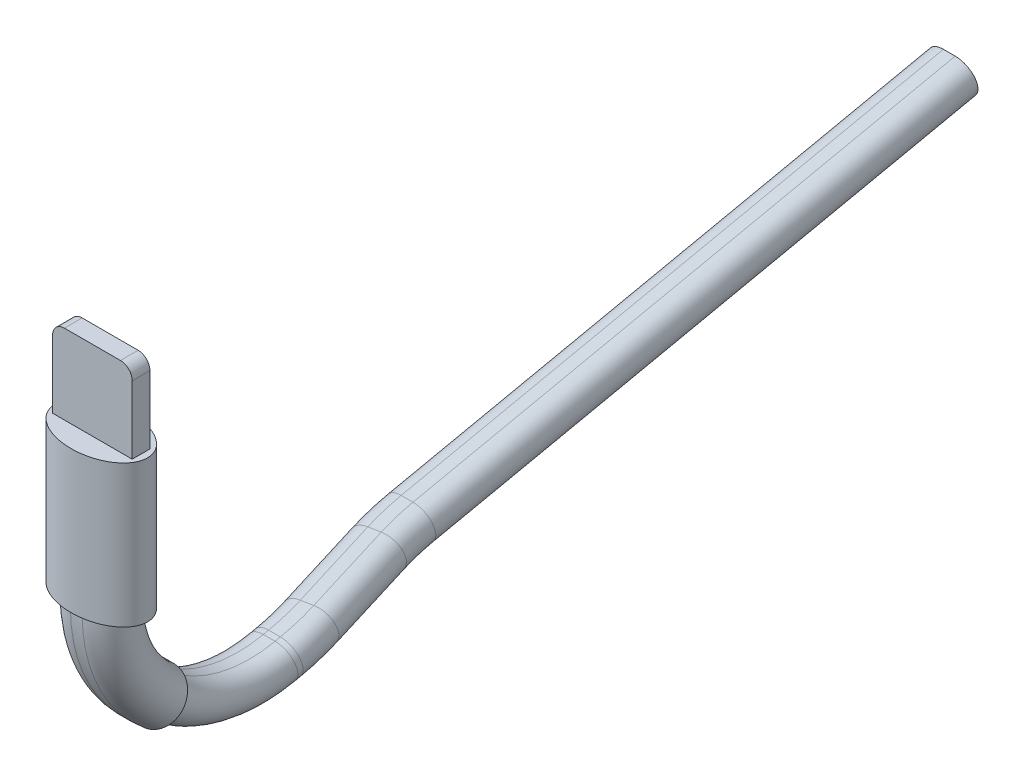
ISO-10303-21;
HEADER;
FILE_DESCRIPTION(('STEP AP214'),'2;1');
FILE_NAME('part.step','',(''),(''),'','','');
FILE_SCHEMA(('AUTOMOTIVE_DESIGN { 1 0 10303 214 1 1 1 1 }'));
ENDSEC;
DATA;
#1=APPLICATION_CONTEXT('core data for automotive mechanical design processes');
#2=APPLICATION_PROTOCOL_DEFINITION('international standard','automotive_design',2000,#1);
#3=PRODUCT_CONTEXT('',#1,'mechanical');
#4=PRODUCT('Part','Part','',(#3));
#5=PRODUCT_RELATED_PRODUCT_CATEGORY('part','',(#4));
#6=PRODUCT_DEFINITION_FORMATION('','',#4);
#7=PRODUCT_DEFINITION_CONTEXT('part definition',#1,'design');
#8=PRODUCT_DEFINITION('design','',#6,#7);
#9=PRODUCT_DEFINITION_SHAPE('','',#8);
#10=(LENGTH_UNIT() NAMED_UNIT(*) SI_UNIT(.MILLI.,.METRE.));
#11=(NAMED_UNIT(*) PLANE_ANGLE_UNIT() SI_UNIT($,.RADIAN.));
#12=(NAMED_UNIT(*) SI_UNIT($,.STERADIAN.) SOLID_ANGLE_UNIT());
#13=UNCERTAINTY_MEASURE_WITH_UNIT(LENGTH_MEASURE(1.E-05),#10,'distance_accuracy_value','');
#14=(GEOMETRIC_REPRESENTATION_CONTEXT(3) GLOBAL_UNCERTAINTY_ASSIGNED_CONTEXT((#13)) GLOBAL_UNIT_ASSIGNED_CONTEXT((#10,
#11,#12)) REPRESENTATION_CONTEXT('',''));
#15=CARTESIAN_POINT('',(0.,0.,0.));
#16=DIRECTION('',(0.,0.,1.));
#17=DIRECTION('',(1.,0.,0.));
#18=AXIS2_PLACEMENT_3D('',#15,#16,#17);
#19=CARTESIAN_POINT('',(0.,12.05,0.));
#20=DIRECTION('',(0.,1.,0.));
#21=DIRECTION('',(0.,0.,1.));
#22=AXIS2_PLACEMENT_3D('',#19,#20,#21);
#23=PLANE('',#22);
#24=CARTESIAN_POINT('',(0.,12.05,0.));
#25=DIRECTION('',(0.,1.,0.));
#26=DIRECTION('',(1.,0.,0.));
#27=AXIS2_PLACEMENT_3D('',#24,#25,#26);
#28=ELLIPSE('',#27,3.925,2.5625);
#29=CARTESIAN_POINT('',(3.925,12.05,0.));
#30=VERTEX_POINT('',#29);
#31=EDGE_CURVE('E409',#30,#30,#28,.T.);
#32=ORIENTED_EDGE('',*,*,#31,.T.);
#33=EDGE_LOOP('',(#32));
#34=FACE_BOUND('',#33,.T.);
#35=DIRECTION('',(-1.,0.,0.));
#36=VECTOR('',#35,1.);
#37=CARTESIAN_POINT('',(-3.375,12.05,-0.75));
#38=LINE('',#37,#36);
#39=CARTESIAN_POINT('',(3.375,12.05,-0.75));
#40=VERTEX_POINT('',#39);
#41=CARTESIAN_POINT('',(-3.375,12.05,-0.75));
#42=VERTEX_POINT('',#41);
#43=EDGE_CURVE('E393',#40,#42,#38,.T.);
#44=ORIENTED_EDGE('',*,*,#43,.F.);
#45=DIRECTION('',(0.,0.,-1.));
#46=VECTOR('',#45,1.);
#47=CARTESIAN_POINT('',(3.375,12.05,-0.75));
#48=LINE('',#47,#46);
#49=CARTESIAN_POINT('',(3.375,12.05,0.75));
#50=VERTEX_POINT('',#49);
#51=EDGE_CURVE('E382',#50,#40,#48,.T.);
#52=ORIENTED_EDGE('',*,*,#51,.F.);
#53=DIRECTION('',(1.,0.,0.));
#54=VECTOR('',#53,1.);
#55=CARTESIAN_POINT('',(-3.375,12.05,0.75));
#56=LINE('',#55,#54);
#57=CARTESIAN_POINT('',(-3.375,12.05,0.75));
#58=VERTEX_POINT('',#57);
#59=EDGE_CURVE('E387',#58,#50,#56,.T.);
#60=ORIENTED_EDGE('',*,*,#59,.F.);
#61=DIRECTION('',(0.,0.,1.));
#62=VECTOR('',#61,1.);
#63=CARTESIAN_POINT('',(-3.375,12.05,-0.75));
#64=LINE('',#63,#62);
#65=EDGE_CURVE('E396',#42,#58,#64,.T.);
#66=ORIENTED_EDGE('',*,*,#65,.F.);
#67=EDGE_LOOP('',(#44,#52,#60,#66));
#68=FACE_BOUND('',#67,.T.);
#69=ADVANCED_FACE('F33',(#34,#68),#23,.T.);
#70=DIRECTION('',(0.,-1.,0.));
#71=VECTOR('',#70,1.);
#72=SURFACE_OF_LINEAR_EXTRUSION('',#28,#71);
#73=ORIENTED_EDGE('',*,*,#31,.F.);
#74=EDGE_LOOP('',(#73));
#75=FACE_BOUND('',#74,.T.);
#76=CARTESIAN_POINT('',(0.,0.,0.));
#77=DIRECTION('',(0.,1.,0.));
#78=DIRECTION('',(1.,0.,0.));
#79=AXIS2_PLACEMENT_3D('',#76,#77,#78);
#80=ELLIPSE('',#79,3.925,2.5625);
#81=CARTESIAN_POINT('',(3.925,0.,0.));
#82=VERTEX_POINT('',#81);
#83=EDGE_CURVE('E408',#82,#82,#80,.T.);
#84=ORIENTED_EDGE('',*,*,#83,.T.);
#85=EDGE_LOOP('',(#84));
#86=FACE_BOUND('',#85,.T.);
#87=ADVANCED_FACE('F416',(#75,#86),#72,.F.);
#88=CARTESIAN_POINT('',(0.,0.,0.));
#89=DIRECTION('',(0.,1.,0.));
#90=DIRECTION('',(0.,0.,1.));
#91=AXIS2_PLACEMENT_3D('',#88,#89,#90);
#92=PLANE('',#91);
#93=CARTESIAN_POINT('',(-0.5,0.,0.));
#94=DIRECTION('',(0.,-1.,0.));
#95=DIRECTION('',(0.,0.,-1.));
#96=AXIS2_PLACEMENT_3D('',#93,#94,#95);
#97=CIRCLE('',#96,2.125);
#98=CARTESIAN_POINT('',(-0.5,0.,2.125));
#99=VERTEX_POINT('',#98);
#100=CARTESIAN_POINT('',(-0.5,0.,-2.125));
#101=VERTEX_POINT('',#100);
#102=EDGE_CURVE('E53',#99,#101,#97,.T.);
#103=ORIENTED_EDGE('',*,*,#102,.F.);
#104=DIRECTION('',(-1.,0.,0.));
#105=VECTOR('',#104,1.);
#106=CARTESIAN_POINT('',(-0.5,0.,2.125));
#107=LINE('',#106,#105);
#108=CARTESIAN_POINT('',(0.5,0.,2.125));
#109=VERTEX_POINT('',#108);
#110=EDGE_CURVE('E327',#109,#99,#107,.T.);
#111=ORIENTED_EDGE('',*,*,#110,.F.);
#112=CARTESIAN_POINT('',(0.5,0.,0.));
#113=DIRECTION('',(0.,-1.,0.));
#114=DIRECTION('',(0.,0.,-1.));
#115=AXIS2_PLACEMENT_3D('',#112,#113,#114);
#116=CIRCLE('',#115,2.125);
#117=CARTESIAN_POINT('',(0.500000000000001,0.,-2.125));
#118=VERTEX_POINT('',#117);
#119=EDGE_CURVE('E324',#118,#109,#116,.T.);
#120=ORIENTED_EDGE('',*,*,#119,.F.);
#121=DIRECTION('',(1.,0.,0.));
#122=VECTOR('',#121,1.);
#123=CARTESIAN_POINT('',(-0.5,0.,-2.125));
#124=LINE('',#123,#122);
#125=EDGE_CURVE('E48',#101,#118,#124,.T.);
#126=ORIENTED_EDGE('',*,*,#125,.F.);
#127=EDGE_LOOP('',(#103,#111,#120,#126));
#128=FACE_BOUND('',#127,.T.);
#129=ORIENTED_EDGE('',*,*,#83,.F.);
#130=EDGE_LOOP('',(#129));
#131=FACE_BOUND('',#130,.T.);
#132=ADVANCED_FACE('F419',(#128,#131),#92,.F.);
#133=CARTESIAN_POINT('',(3.375,18.8,-0.75));
#134=DIRECTION('',(-1.,0.,0.));
#135=DIRECTION('',(0.,0.,1.));
#136=AXIS2_PLACEMENT_3D('',#133,#134,#135);
#137=PLANE('',#136);
#138=DIRECTION('',(0.,-1.,0.));
#139=VECTOR('',#138,1.);
#140=CARTESIAN_POINT('',(3.375,18.8,-0.75));
#141=LINE('',#140,#139);
#142=CARTESIAN_POINT('',(3.375,17.8,-0.75));
#143=VERTEX_POINT('',#142);
#144=EDGE_CURVE('E406',#143,#40,#141,.T.);
#145=ORIENTED_EDGE('',*,*,#144,.F.);
#146=DIRECTION('',(0.,0.,-1.));
#147=VECTOR('',#146,1.);
#148=CARTESIAN_POINT('',(3.375,17.8,0.75));
#149=LINE('',#148,#147);
#150=CARTESIAN_POINT('',(3.375,17.8,0.75));
#151=VERTEX_POINT('',#150);
#152=EDGE_CURVE('E41',#143,#151,#149,.F.);
#153=ORIENTED_EDGE('',*,*,#152,.T.);
#154=DIRECTION('',(0.,-1.,0.));
#155=VECTOR('',#154,1.);
#156=CARTESIAN_POINT('',(3.375,18.8,0.75));
#157=LINE('',#156,#155);
#158=EDGE_CURVE('E390',#151,#50,#157,.T.);
#159=ORIENTED_EDGE('',*,*,#158,.T.);
#160=ORIENTED_EDGE('',*,*,#51,.T.);
#161=EDGE_LOOP('',(#145,#153,#159,#160));
#162=FACE_BOUND('',#161,.T.);
#163=ADVANCED_FACE('F442',(#162),#137,.F.);
#164=CARTESIAN_POINT('',(-3.375,18.8,-0.75));
#165=DIRECTION('',(0.,0.,1.));
#166=DIRECTION('',(1.,0.,0.));
#167=AXIS2_PLACEMENT_3D('',#164,#165,#166);
#168=PLANE('',#167);
#169=DIRECTION('',(0.,-1.,0.));
#170=VECTOR('',#169,1.);
#171=CARTESIAN_POINT('',(-3.375,18.8,-0.75));
#172=LINE('',#171,#170);
#173=CARTESIAN_POINT('',(-3.375,17.8,-0.75));
#174=VERTEX_POINT('',#173);
#175=EDGE_CURVE('E404',#174,#42,#172,.T.);
#176=ORIENTED_EDGE('',*,*,#175,.F.);
#177=CARTESIAN_POINT('',(-2.375,17.8,-0.75));
#178=DIRECTION('',(0.,0.,1.));
#179=DIRECTION('',(1.,0.,0.));
#180=AXIS2_PLACEMENT_3D('',#177,#178,#179);
#181=CIRCLE('',#180,1.);
#182=CARTESIAN_POINT('',(-2.375,18.8,-0.75));
#183=VERTEX_POINT('',#182);
#184=EDGE_CURVE('E858',#174,#183,#181,.F.);
#185=ORIENTED_EDGE('',*,*,#184,.T.);
#186=DIRECTION('',(-1.,0.,0.));
#187=VECTOR('',#186,1.);
#188=CARTESIAN_POINT('',(-3.375,18.8,-0.75));
#189=LINE('',#188,#187);
#190=CARTESIAN_POINT('',(2.375,18.8,-0.75));
#191=VERTEX_POINT('',#190);
#192=EDGE_CURVE('E383',#191,#183,#189,.T.);
#193=ORIENTED_EDGE('',*,*,#192,.F.);
#194=CARTESIAN_POINT('',(2.375,17.8,-0.75));
#195=DIRECTION('',(0.,0.,1.));
#196=DIRECTION('',(1.,0.,0.));
#197=AXIS2_PLACEMENT_3D('',#194,#195,#196);
#198=CIRCLE('',#197,1.);
#199=EDGE_CURVE('E850',#191,#143,#198,.F.);
#200=ORIENTED_EDGE('',*,*,#199,.T.);
#201=ORIENTED_EDGE('',*,*,#144,.T.);
#202=ORIENTED_EDGE('',*,*,#43,.T.);
#203=EDGE_LOOP('',(#176,#185,#193,#200,#201,#202));
#204=FACE_BOUND('',#203,.T.);
#205=ADVANCED_FACE('F445',(#204),#168,.F.);
#206=CARTESIAN_POINT('',(-3.375,18.8,-0.75));
#207=DIRECTION('',(1.,0.,0.));
#208=DIRECTION('',(0.,0.,-1.));
#209=AXIS2_PLACEMENT_3D('',#206,#207,#208);
#210=PLANE('',#209);
#211=DIRECTION('',(0.,-1.,0.));
#212=VECTOR('',#211,1.);
#213=CARTESIAN_POINT('',(-3.375,18.8,0.75));
#214=LINE('',#213,#212);
#215=CARTESIAN_POINT('',(-3.375,17.8,0.75));
#216=VERTEX_POINT('',#215);
#217=EDGE_CURVE('E402',#216,#58,#214,.T.);
#218=ORIENTED_EDGE('',*,*,#217,.F.);
#219=DIRECTION('',(0.,0.,1.));
#220=VECTOR('',#219,1.);
#221=CARTESIAN_POINT('',(-3.375,17.8,-0.75));
#222=LINE('',#221,#220);
#223=EDGE_CURVE('E855',#216,#174,#222,.F.);
#224=ORIENTED_EDGE('',*,*,#223,.T.);
#225=ORIENTED_EDGE('',*,*,#175,.T.);
#226=ORIENTED_EDGE('',*,*,#65,.T.);
#227=EDGE_LOOP('',(#218,#224,#225,#226));
#228=FACE_BOUND('',#227,.T.);
#229=ADVANCED_FACE('F449',(#228),#210,.F.);
#230=CARTESIAN_POINT('',(-3.375,18.8,0.75));
#231=DIRECTION('',(0.,0.,-1.));
#232=DIRECTION('',(-1.,0.,0.));
#233=AXIS2_PLACEMENT_3D('',#230,#231,#232);
#234=PLANE('',#233);
#235=DIRECTION('',(1.,0.,0.));
#236=VECTOR('',#235,1.);
#237=CARTESIAN_POINT('',(-3.375,18.8,0.75));
#238=LINE('',#237,#236);
#239=CARTESIAN_POINT('',(-2.375,18.8,0.75));
#240=VERTEX_POINT('',#239);
#241=CARTESIAN_POINT('',(2.375,18.8,0.75));
#242=VERTEX_POINT('',#241);
#243=EDGE_CURVE('E386',#240,#242,#238,.T.);
#244=ORIENTED_EDGE('',*,*,#243,.F.);
#245=CARTESIAN_POINT('',(-2.375,17.8,0.75));
#246=DIRECTION('',(0.,0.,-1.));
#247=DIRECTION('',(-1.,0.,0.));
#248=AXIS2_PLACEMENT_3D('',#245,#246,#247);
#249=CIRCLE('',#248,1.);
#250=EDGE_CURVE('E838',#240,#216,#249,.F.);
#251=ORIENTED_EDGE('',*,*,#250,.T.);
#252=ORIENTED_EDGE('',*,*,#217,.T.);
#253=ORIENTED_EDGE('',*,*,#59,.T.);
#254=ORIENTED_EDGE('',*,*,#158,.F.);
#255=CARTESIAN_POINT('',(2.375,17.8,0.75));
#256=DIRECTION('',(0.,0.,-1.));
#257=DIRECTION('',(-1.,0.,0.));
#258=AXIS2_PLACEMENT_3D('',#255,#256,#257);
#259=CIRCLE('',#258,1.);
#260=EDGE_CURVE('E842',#151,#242,#259,.F.);
#261=ORIENTED_EDGE('',*,*,#260,.T.);
#262=EDGE_LOOP('',(#244,#251,#252,#253,#254,#261));
#263=FACE_BOUND('',#262,.T.);
#264=ADVANCED_FACE('F432',(#263),#234,.F.);
#265=CARTESIAN_POINT('',(0.,18.8,0.));
#266=DIRECTION('',(0.,1.,0.));
#267=DIRECTION('',(0.,0.,1.));
#268=AXIS2_PLACEMENT_3D('',#265,#266,#267);
#269=PLANE('',#268);
#270=ORIENTED_EDGE('',*,*,#192,.T.);
#271=DIRECTION('',(0.,0.,1.));
#272=VECTOR('',#271,1.);
#273=CARTESIAN_POINT('',(-2.375,18.8,0.75));
#274=LINE('',#273,#272);
#275=EDGE_CURVE('E848',#183,#240,#274,.T.);
#276=ORIENTED_EDGE('',*,*,#275,.T.);
#277=ORIENTED_EDGE('',*,*,#243,.T.);
#278=DIRECTION('',(0.,0.,-1.));
#279=VECTOR('',#278,1.);
#280=CARTESIAN_POINT('',(2.375,18.8,-0.75));
#281=LINE('',#280,#279);
#282=EDGE_CURVE('E413',#242,#191,#281,.T.);
#283=ORIENTED_EDGE('',*,*,#282,.T.);
#284=EDGE_LOOP('',(#270,#276,#277,#283));
#285=FACE_BOUND('',#284,.T.);
#286=ADVANCED_FACE('F424',(#285),#269,.T.);
#287=CARTESIAN_POINT('',(-2.375,17.8,0.));
#288=DIRECTION('',(0.,0.,-1.));
#289=DIRECTION('',(-1.,0.,0.));
#290=AXIS2_PLACEMENT_3D('',#287,#288,#289);
#291=CYLINDRICAL_SURFACE('',#290,1.);
#292=ORIENTED_EDGE('',*,*,#184,.F.);
#293=ORIENTED_EDGE('',*,*,#223,.F.);
#294=ORIENTED_EDGE('',*,*,#250,.F.);
#295=ORIENTED_EDGE('',*,*,#275,.F.);
#296=EDGE_LOOP('',(#292,#293,#294,#295));
#297=FACE_BOUND('',#296,.T.);
#298=ADVANCED_FACE('F422',(#297),#291,.T.);
#299=CARTESIAN_POINT('',(2.375,17.8,0.));
#300=DIRECTION('',(0.,0.,1.));
#301=DIRECTION('',(1.,0.,0.));
#302=AXIS2_PLACEMENT_3D('',#299,#300,#301);
#303=CYLINDRICAL_SURFACE('',#302,1.);
#304=ORIENTED_EDGE('',*,*,#260,.F.);
#305=ORIENTED_EDGE('',*,*,#152,.F.);
#306=ORIENTED_EDGE('',*,*,#199,.F.);
#307=ORIENTED_EDGE('',*,*,#282,.F.);
#308=EDGE_LOOP('',(#304,#305,#306,#307));
#309=FACE_BOUND('',#308,.T.);
#310=ADVANCED_FACE('F35',(#309),#303,.T.);
#311=CARTESIAN_POINT('',(-0.5,0.,-12.0563837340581));
#312=DIRECTION('',(-1.,0.,0.));
#313=DIRECTION('',(0.,0.,1.));
#314=AXIS2_PLACEMENT_3D('',#311,#312,#313);
#315=TOROIDAL_SURFACE('',#314,12.0563837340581,2.125);
#316=CARTESIAN_POINT('',(-0.5,0.,-12.0563837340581));
#317=DIRECTION('',(-1.,0.,0.));
#318=DIRECTION('',(0.,0.,1.));
#319=AXIS2_PLACEMENT_3D('',#316,#317,#318);
#320=CIRCLE('',#319,9.93138373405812);
#321=CARTESIAN_POINT('',(-0.5,-7.59665513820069,-5.65925831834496));
#322=VERTEX_POINT('',#321);
#323=EDGE_CURVE('E350',#322,#101,#320,.T.);
#324=ORIENTED_EDGE('',*,*,#323,.F.);
#325=CARTESIAN_POINT('',(-0.5,-9.22209753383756,-4.2904771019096));
#326=DIRECTION('',(0.,-0.644132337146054,-0.764914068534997));
#327=DIRECTION('',(0.,0.764914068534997,-0.644132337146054));
#328=AXIS2_PLACEMENT_3D('',#325,#326,#327);
#329=CIRCLE('',#328,2.125);
#330=CARTESIAN_POINT('',(-0.5,-10.8475399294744,-2.92169588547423));
#331=VERTEX_POINT('',#330);
#332=EDGE_CURVE('E330',#331,#322,#329,.T.);
#333=ORIENTED_EDGE('',*,*,#332,.F.);
#334=CARTESIAN_POINT('',(-0.5,0.,-12.0563837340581));
#335=DIRECTION('',(-1.,0.,0.));
#336=DIRECTION('',(0.,0.,1.));
#337=AXIS2_PLACEMENT_3D('',#334,#335,#336);
#338=CIRCLE('',#337,14.1813837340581);
#339=EDGE_CURVE('E342',#331,#99,#338,.T.);
#340=ORIENTED_EDGE('',*,*,#339,.T.);
#341=ORIENTED_EDGE('',*,*,#102,.T.);
#342=EDGE_LOOP('',(#324,#333,#340,#341));
#343=FACE_BOUND('',#342,.T.);
#344=ADVANCED_FACE('F430',(#343),#315,.T.);
#345=CARTESIAN_POINT('',(0.,0.,-12.0563837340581));
#346=DIRECTION('',(-1.,0.,0.));
#347=DIRECTION('',(0.,0.,1.));
#348=AXIS2_PLACEMENT_3D('',#345,#346,#347);
#349=CYLINDRICAL_SURFACE('',#348,9.93138373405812);
#350=CARTESIAN_POINT('',(0.500000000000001,0.,-12.0563837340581));
#351=DIRECTION('',(-1.,0.,0.));
#352=DIRECTION('',(0.,0.,1.));
#353=AXIS2_PLACEMENT_3D('',#350,#351,#352);
#354=CIRCLE('',#353,9.93138373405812);
#355=CARTESIAN_POINT('',(0.500000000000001,-7.59665513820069,-5.65925831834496));
#356=VERTEX_POINT('',#355);
#357=EDGE_CURVE('E347',#356,#118,#354,.T.);
#358=ORIENTED_EDGE('',*,*,#357,.F.);
#359=DIRECTION('',(1.,0.,0.));
#360=VECTOR('',#359,1.);
#361=CARTESIAN_POINT('',(-0.5,-7.59665513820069,-5.65925831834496));
#362=LINE('',#361,#360);
#363=EDGE_CURVE('E333',#322,#356,#362,.T.);
#364=ORIENTED_EDGE('',*,*,#363,.F.);
#365=ORIENTED_EDGE('',*,*,#323,.T.);
#366=ORIENTED_EDGE('',*,*,#125,.T.);
#367=EDGE_LOOP('',(#358,#364,#365,#366));
#368=FACE_BOUND('',#367,.T.);
#369=ADVANCED_FACE('F475',(#368),#349,.F.);
#370=CARTESIAN_POINT('',(0.5,0.,-12.0563837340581));
#371=DIRECTION('',(-1.,0.,0.));
#372=DIRECTION('',(0.,0.,1.));
#373=AXIS2_PLACEMENT_3D('',#370,#371,#372);
#374=TOROIDAL_SURFACE('',#373,12.0563837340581,2.125);
#375=CARTESIAN_POINT('',(0.499999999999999,0.,-12.0563837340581));
#376=DIRECTION('',(-1.,0.,0.));
#377=DIRECTION('',(0.,0.,1.));
#378=AXIS2_PLACEMENT_3D('',#375,#376,#377);
#379=CIRCLE('',#378,14.1813837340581);
#380=CARTESIAN_POINT('',(0.499999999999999,-10.8475399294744,-2.92169588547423));
#381=VERTEX_POINT('',#380);
#382=EDGE_CURVE('E344',#381,#109,#379,.T.);
#383=ORIENTED_EDGE('',*,*,#382,.F.);
#384=CARTESIAN_POINT('',(0.5,-9.22209753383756,-4.2904771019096));
#385=DIRECTION('',(0.,-0.644132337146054,-0.764914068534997));
#386=DIRECTION('',(0.,0.764914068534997,-0.644132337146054));
#387=AXIS2_PLACEMENT_3D('',#384,#385,#386);
#388=CIRCLE('',#387,2.125);
#389=EDGE_CURVE('E336',#356,#381,#388,.T.);
#390=ORIENTED_EDGE('',*,*,#389,.F.);
#391=ORIENTED_EDGE('',*,*,#357,.T.);
#392=ORIENTED_EDGE('',*,*,#119,.T.);
#393=EDGE_LOOP('',(#383,#390,#391,#392));
#394=FACE_BOUND('',#393,.T.);
#395=ADVANCED_FACE('F478',(#394),#374,.T.);
#396=CARTESIAN_POINT('',(0.,0.,-12.0563837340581));
#397=DIRECTION('',(-1.,0.,0.));
#398=DIRECTION('',(0.,0.,1.));
#399=AXIS2_PLACEMENT_3D('',#396,#397,#398);
#400=CYLINDRICAL_SURFACE('',#399,14.1813837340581);
#401=DIRECTION('',(-1.,0.,0.));
#402=VECTOR('',#401,1.);
#403=CARTESIAN_POINT('',(-0.5,-10.8475399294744,-2.92169588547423));
#404=LINE('',#403,#402);
#405=EDGE_CURVE('E339',#381,#331,#404,.T.);
#406=ORIENTED_EDGE('',*,*,#405,.F.);
#407=ORIENTED_EDGE('',*,*,#382,.T.);
#408=ORIENTED_EDGE('',*,*,#110,.T.);
#409=ORIENTED_EDGE('',*,*,#339,.F.);
#410=EDGE_LOOP('',(#406,#407,#408,#409));
#411=FACE_BOUND('',#410,.T.);
#412=ADVANCED_FACE('F482',(#411),#400,.T.);
#413=CARTESIAN_POINT('',(-0.5,-9.22209753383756,-4.2904771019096));
#414=DIRECTION('',(0.,-0.644132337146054,-0.764914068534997));
#415=DIRECTION('',(0.,0.764914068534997,-0.644132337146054));
#416=AXIS2_PLACEMENT_3D('',#413,#414,#415);
#417=PLANE('',#416);
#418=DIRECTION('',(-1.,0.,0.));
#419=VECTOR('',#418,1.);
#420=CARTESIAN_POINT('',(0.,-8.01735787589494,-5.30498553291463));
#421=LINE('',#420,#419);
#422=CARTESIAN_POINT('',(0.499999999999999,-8.01735787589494,-5.30498553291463));
#423=VERTEX_POINT('',#422);
#424=CARTESIAN_POINT('',(-0.5,-8.01735787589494,-5.30498553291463));
#425=VERTEX_POINT('',#424);
#426=EDGE_CURVE('E11',#423,#425,#421,.T.);
#427=ORIENTED_EDGE('',*,*,#426,.T.);
#428=CARTESIAN_POINT('',(-0.5,-9.22209753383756,-4.2904771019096));
#429=DIRECTION('',(0.,-0.644132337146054,-0.764914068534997));
#430=DIRECTION('',(0.,0.764914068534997,-0.644132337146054));
#431=AXIS2_PLACEMENT_3D('',#428,#429,#430);
#432=CIRCLE('',#431,1.575);
#433=CARTESIAN_POINT('',(-0.5,-10.4268371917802,-3.27596867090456));
#434=VERTEX_POINT('',#433);
#435=EDGE_CURVE('E358',#425,#434,#432,.F.);
#436=ORIENTED_EDGE('',*,*,#435,.T.);
#437=DIRECTION('',(-1.,0.,0.));
#438=VECTOR('',#437,1.);
#439=CARTESIAN_POINT('',(0.,-10.4268371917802,-3.27596867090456));
#440=LINE('',#439,#438);
#441=CARTESIAN_POINT('',(0.500000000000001,-10.4268371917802,-3.27596867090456));
#442=VERTEX_POINT('',#441);
#443=EDGE_CURVE('E355',#434,#442,#440,.F.);
#444=ORIENTED_EDGE('',*,*,#443,.T.);
#445=CARTESIAN_POINT('',(0.5,-9.22209753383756,-4.2904771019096));
#446=DIRECTION('',(0.,-0.644132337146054,-0.764914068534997));
#447=DIRECTION('',(0.,0.764914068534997,-0.644132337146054));
#448=AXIS2_PLACEMENT_3D('',#445,#446,#447);
#449=CIRCLE('',#448,1.575);
#450=EDGE_CURVE('E352',#442,#423,#449,.F.);
#451=ORIENTED_EDGE('',*,*,#450,.T.);
#452=EDGE_LOOP('',(#427,#436,#444,#451));
#453=FACE_BOUND('',#452,.T.);
#454=ORIENTED_EDGE('',*,*,#332,.T.);
#455=ORIENTED_EDGE('',*,*,#363,.T.);
#456=ORIENTED_EDGE('',*,*,#389,.T.);
#457=ORIENTED_EDGE('',*,*,#405,.T.);
#458=EDGE_LOOP('',(#454,#455,#456,#457));
#459=FACE_BOUND('',#458,.T.);
#460=ADVANCED_FACE('F469',(#453,#459),#417,.T.);
#461=CARTESIAN_POINT('',(0.,0.,-12.0563837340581));
#462=DIRECTION('',(-1.,0.,0.));
#463=DIRECTION('',(0.,0.,1.));
#464=AXIS2_PLACEMENT_3D('',#461,#462,#463);
#465=CYLINDRICAL_SURFACE('',#464,10.4813837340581);
#466=ORIENTED_EDGE('',*,*,#426,.F.);
#467=CARTESIAN_POINT('',(0.499999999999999,0.,-12.0563837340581));
#468=DIRECTION('',(-1.,0.,0.));
#469=DIRECTION('',(0.,0.,1.));
#470=AXIS2_PLACEMENT_3D('',#467,#468,#469);
#471=CIRCLE('',#470,10.4813837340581);
#472=CARTESIAN_POINT('',(0.5,-10.2523403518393,-14.235585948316));
#473=VERTEX_POINT('',#472);
#474=EDGE_CURVE('E373',#473,#423,#471,.T.);
#475=ORIENTED_EDGE('',*,*,#474,.F.);
#476=DIRECTION('',(-1.,0.,0.));
#477=VECTOR('',#476,1.);
#478=CARTESIAN_POINT('',(-0.5,-10.2523403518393,-14.2355859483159));
#479=LINE('',#478,#477);
#480=CARTESIAN_POINT('',(-0.5,-10.2523403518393,-14.235585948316));
#481=VERTEX_POINT('',#480);
#482=EDGE_CURVE('E368',#473,#481,#479,.T.);
#483=ORIENTED_EDGE('',*,*,#482,.T.);
#484=CARTESIAN_POINT('',(-0.5,0.,-12.0563837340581));
#485=DIRECTION('',(-1.,0.,0.));
#486=DIRECTION('',(0.,0.,1.));
#487=AXIS2_PLACEMENT_3D('',#484,#485,#486);
#488=CIRCLE('',#487,10.4813837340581);
#489=EDGE_CURVE('E371',#481,#425,#488,.T.);
#490=ORIENTED_EDGE('',*,*,#489,.T.);
#491=EDGE_LOOP('',(#466,#475,#483,#490));
#492=FACE_BOUND('',#491,.T.);
#493=ADVANCED_FACE('F465',(#492),#465,.F.);
#494=CARTESIAN_POINT('',(0.5,0.,-12.0563837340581));
#495=DIRECTION('',(-1.,0.,0.));
#496=DIRECTION('',(0.,0.,1.));
#497=AXIS2_PLACEMENT_3D('',#494,#495,#496);
#498=TOROIDAL_SURFACE('',#497,12.0563837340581,1.575);
#499=ORIENTED_EDGE('',*,*,#450,.F.);
#500=CARTESIAN_POINT('',(0.500000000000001,0.,-12.0563837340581));
#501=DIRECTION('',(-1.,0.,0.));
#502=DIRECTION('',(0.,0.,1.));
#503=AXIS2_PLACEMENT_3D('',#500,#501,#502);
#504=CIRCLE('',#503,13.6313837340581);
#505=CARTESIAN_POINT('',(0.500000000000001,-13.3335052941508,-14.8905077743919));
#506=VERTEX_POINT('',#505);
#507=EDGE_CURVE('E376',#506,#442,#504,.T.);
#508=ORIENTED_EDGE('',*,*,#507,.F.);
#509=CARTESIAN_POINT('',(0.5,-11.792922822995,-14.5630468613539));
#510=DIRECTION('',(0.,-0.207911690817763,0.978147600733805));
#511=DIRECTION('',(0.,-0.978147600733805,-0.207911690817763));
#512=AXIS2_PLACEMENT_3D('',#509,#510,#511);
#513=CIRCLE('',#512,1.575);
#514=EDGE_CURVE('E365',#506,#473,#513,.T.);
#515=ORIENTED_EDGE('',*,*,#514,.T.);
#516=ORIENTED_EDGE('',*,*,#474,.T.);
#517=EDGE_LOOP('',(#499,#508,#515,#516));
#518=FACE_BOUND('',#517,.T.);
#519=ADVANCED_FACE('F461',(#518),#498,.T.);
#520=CARTESIAN_POINT('',(0.,0.,-12.0563837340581));
#521=DIRECTION('',(-1.,0.,0.));
#522=DIRECTION('',(0.,0.,1.));
#523=AXIS2_PLACEMENT_3D('',#520,#521,#522);
#524=CYLINDRICAL_SURFACE('',#523,13.6313837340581);
#525=ORIENTED_EDGE('',*,*,#443,.F.);
#526=CARTESIAN_POINT('',(-0.5,0.,-12.0563837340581));
#527=DIRECTION('',(-1.,0.,0.));
#528=DIRECTION('',(0.,0.,1.));
#529=AXIS2_PLACEMENT_3D('',#526,#527,#528);
#530=CIRCLE('',#529,13.6313837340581);
#531=CARTESIAN_POINT('',(-0.5,-13.3335052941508,-14.8905077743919));
#532=VERTEX_POINT('',#531);
#533=EDGE_CURVE('E379',#532,#434,#530,.T.);
#534=ORIENTED_EDGE('',*,*,#533,.F.);
#535=DIRECTION('',(1.,0.,0.));
#536=VECTOR('',#535,1.);
#537=CARTESIAN_POINT('',(-0.5,-13.3335052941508,-14.8905077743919));
#538=LINE('',#537,#536);
#539=EDGE_CURVE('E362',#532,#506,#538,.T.);
#540=ORIENTED_EDGE('',*,*,#539,.T.);
#541=ORIENTED_EDGE('',*,*,#507,.T.);
#542=EDGE_LOOP('',(#525,#534,#540,#541));
#543=FACE_BOUND('',#542,.T.);
#544=ADVANCED_FACE('F457',(#543),#524,.T.);
#545=CARTESIAN_POINT('',(-0.5,0.,-12.0563837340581));
#546=DIRECTION('',(-1.,0.,0.));
#547=DIRECTION('',(0.,0.,1.));
#548=AXIS2_PLACEMENT_3D('',#545,#546,#547);
#549=TOROIDAL_SURFACE('',#548,12.0563837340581,1.575);
#550=ORIENTED_EDGE('',*,*,#435,.F.);
#551=ORIENTED_EDGE('',*,*,#489,.F.);
#552=CARTESIAN_POINT('',(-0.5,-11.792922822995,-14.5630468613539));
#553=DIRECTION('',(0.,-0.207911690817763,0.978147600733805));
#554=DIRECTION('',(0.,-0.978147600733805,-0.207911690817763));
#555=AXIS2_PLACEMENT_3D('',#552,#553,#554);
#556=CIRCLE('',#555,1.575);
#557=EDGE_CURVE('E229',#481,#532,#556,.T.);
#558=ORIENTED_EDGE('',*,*,#557,.T.);
#559=ORIENTED_EDGE('',*,*,#533,.T.);
#560=EDGE_LOOP('',(#550,#551,#558,#559));
#561=FACE_BOUND('',#560,.T.);
#562=ADVANCED_FACE('F460',(#561),#549,.T.);
#563=CARTESIAN_POINT('',(-2.05000000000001,-7.43704962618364,-27.4804874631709));
#564=DIRECTION('',(0.,0.978147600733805,0.20791169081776));
#565=DIRECTION('',(0.,-0.20791169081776,0.978147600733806));
#566=AXIS2_PLACEMENT_3D('',#563,#564,#565);
#567=PLANE('',#566);
#568=DIRECTION('',(1.,0.,0.));
#569=VECTOR('',#568,1.);
#570=CARTESIAN_POINT('',(-2.05000000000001,-7.43704962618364,-27.4804874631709));
#571=LINE('',#570,#569);
#572=CARTESIAN_POINT('',(-2.05000000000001,-7.43704962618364,-27.4804874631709));
#573=VERTEX_POINT('',#572);
#574=CARTESIAN_POINT('',(-1.05000000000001,-7.43704962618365,-27.4804874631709));
#575=VERTEX_POINT('',#574);
#576=EDGE_CURVE('E283',#573,#575,#571,.T.);
#577=ORIENTED_EDGE('',*,*,#576,.T.);
#578=DIRECTION('',(0.,0.20791169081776,-0.978147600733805));
#579=VECTOR('',#578,1.);
#580=CARTESIAN_POINT('',(-1.05000000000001,-7.43704962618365,-27.4804874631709));
#581=LINE('',#580,#579);
#582=CARTESIAN_POINT('',(-1.05,2.33548156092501,-73.4566319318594));
#583=VERTEX_POINT('',#582);
#584=EDGE_CURVE('E316',#575,#583,#581,.T.);
#585=ORIENTED_EDGE('',*,*,#584,.T.);
#586=DIRECTION('',(1.,0.,0.));
#587=VECTOR('',#586,1.);
#588=CARTESIAN_POINT('',(-2.05,2.33548156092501,-73.4566319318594));
#589=LINE('',#588,#587);
#590=CARTESIAN_POINT('',(-2.05,2.33548156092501,-73.4566319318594));
#591=VERTEX_POINT('',#590);
#592=EDGE_CURVE('E307',#591,#583,#589,.T.);
#593=ORIENTED_EDGE('',*,*,#592,.F.);
#594=DIRECTION('',(0.,0.20791169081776,-0.978147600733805));
#595=VECTOR('',#594,1.);
#596=CARTESIAN_POINT('',(-2.05000000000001,-7.43704962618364,-27.4804874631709));
#597=LINE('',#596,#595);
#598=EDGE_CURVE('E319',#573,#591,#597,.T.);
#599=ORIENTED_EDGE('',*,*,#598,.F.);
#600=EDGE_LOOP('',(#577,#585,#593,#599));
#601=FACE_BOUND('',#600,.T.);
#602=ADVANCED_FACE('F473',(#601),#567,.T.);
#603=CARTESIAN_POINT('',(-1.05,-8.97763209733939,-27.8079483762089));
#604=DIRECTION('',(0.,0.20791169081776,-0.978147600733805));
#605=DIRECTION('',(0.,0.978147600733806,0.20791169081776));
#606=AXIS2_PLACEMENT_3D('',#603,#604,#605);
#607=CYLINDRICAL_SURFACE('',#606,1.575);
#608=CARTESIAN_POINT('',(-1.05,-8.97763209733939,-27.8079483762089));
#609=DIRECTION('',(0.,0.207911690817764,-0.978147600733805));
#610=DIRECTION('',(0.,0.978147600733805,0.207911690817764));
#611=AXIS2_PLACEMENT_3D('',#608,#609,#610);
#612=CIRCLE('',#611,1.575);
#613=CARTESIAN_POINT('',(-1.05,-10.5182145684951,-28.1354092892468));
#614=VERTEX_POINT('',#613);
#615=EDGE_CURVE('E280',#575,#614,#612,.T.);
#616=ORIENTED_EDGE('',*,*,#615,.T.);
#617=DIRECTION('',(0.,0.20791169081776,-0.978147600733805));
#618=VECTOR('',#617,1.);
#619=CARTESIAN_POINT('',(-1.05,-10.5182145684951,-28.1354092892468));
#620=LINE('',#619,#618);
#621=CARTESIAN_POINT('',(-1.05,-0.74568338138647,-74.1115537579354));
#622=VERTEX_POINT('',#621);
#623=EDGE_CURVE('E313',#614,#622,#620,.T.);
#624=ORIENTED_EDGE('',*,*,#623,.T.);
#625=CARTESIAN_POINT('',(-1.05,0.794899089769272,-73.7840928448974));
#626=DIRECTION('',(0.,0.207911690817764,-0.978147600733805));
#627=DIRECTION('',(0.,0.978147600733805,0.207911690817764));
#628=AXIS2_PLACEMENT_3D('',#625,#626,#627);
#629=CIRCLE('',#628,1.575);
#630=EDGE_CURVE('E304',#583,#622,#629,.T.);
#631=ORIENTED_EDGE('',*,*,#630,.F.);
#632=ORIENTED_EDGE('',*,*,#584,.F.);
#633=EDGE_LOOP('',(#616,#624,#631,#632));
#634=FACE_BOUND('',#633,.T.);
#635=ADVANCED_FACE('F495',(#634),#607,.T.);
#636=CARTESIAN_POINT('',(-1.05,-10.5182145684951,-28.1354092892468));
#637=DIRECTION('',(0.,-0.978147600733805,-0.20791169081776));
#638=DIRECTION('',(0.,0.20791169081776,-0.978147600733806));
#639=AXIS2_PLACEMENT_3D('',#636,#637,#638);
#640=PLANE('',#639);
#641=DIRECTION('',(-1.,0.,0.));
#642=VECTOR('',#641,1.);
#643=CARTESIAN_POINT('',(-1.05,-10.5182145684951,-28.1354092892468));
#644=LINE('',#643,#642);
#645=CARTESIAN_POINT('',(-2.05,-10.5182145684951,-28.1354092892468));
#646=VERTEX_POINT('',#645);
#647=EDGE_CURVE('E277',#614,#646,#644,.T.);
#648=ORIENTED_EDGE('',*,*,#647,.T.);
#649=DIRECTION('',(0.,0.20791169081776,-0.978147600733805));
#650=VECTOR('',#649,1.);
#651=CARTESIAN_POINT('',(-2.05,-10.5182145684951,-28.1354092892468));
#652=LINE('',#651,#650);
#653=CARTESIAN_POINT('',(-2.05,-0.745683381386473,-74.1115537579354));
#654=VERTEX_POINT('',#653);
#655=EDGE_CURVE('E310',#646,#654,#652,.T.);
#656=ORIENTED_EDGE('',*,*,#655,.T.);
#657=DIRECTION('',(-1.,0.,0.));
#658=VECTOR('',#657,1.);
#659=CARTESIAN_POINT('',(-1.05,-0.74568338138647,-74.1115537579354));
#660=LINE('',#659,#658);
#661=EDGE_CURVE('E301',#622,#654,#660,.T.);
#662=ORIENTED_EDGE('',*,*,#661,.F.);
#663=ORIENTED_EDGE('',*,*,#623,.F.);
#664=EDGE_LOOP('',(#648,#656,#662,#663));
#665=FACE_BOUND('',#664,.T.);
#666=ADVANCED_FACE('F499',(#665),#640,.T.);
#667=CARTESIAN_POINT('',(-2.05000000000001,-8.97763209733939,-27.8079483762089));
#668=DIRECTION('',(0.,0.20791169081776,-0.978147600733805));
#669=DIRECTION('',(0.,0.978147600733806,0.20791169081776));
#670=AXIS2_PLACEMENT_3D('',#667,#668,#669);
#671=CYLINDRICAL_SURFACE('',#670,1.575);
#672=CARTESIAN_POINT('',(-2.05000000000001,-8.97763209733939,-27.8079483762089));
#673=DIRECTION('',(0.,0.207911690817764,-0.978147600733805));
#674=DIRECTION('',(0.,0.978147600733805,0.207911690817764));
#675=AXIS2_PLACEMENT_3D('',#672,#673,#674);
#676=CIRCLE('',#675,1.575);
#677=EDGE_CURVE('E274',#646,#573,#676,.T.);
#678=ORIENTED_EDGE('',*,*,#677,.T.);
#679=ORIENTED_EDGE('',*,*,#598,.T.);
#680=CARTESIAN_POINT('',(-2.05,0.794899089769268,-73.7840928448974));
#681=DIRECTION('',(0.,0.207911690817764,-0.978147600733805));
#682=DIRECTION('',(0.,0.978147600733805,0.207911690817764));
#683=AXIS2_PLACEMENT_3D('',#680,#681,#682);
#684=CIRCLE('',#683,1.575);
#685=EDGE_CURVE('E298',#654,#591,#684,.T.);
#686=ORIENTED_EDGE('',*,*,#685,.F.);
#687=ORIENTED_EDGE('',*,*,#655,.F.);
#688=EDGE_LOOP('',(#678,#679,#686,#687));
#689=FACE_BOUND('',#688,.T.);
#690=ADVANCED_FACE('F503',(#689),#671,.T.);
#691=CARTESIAN_POINT('',(-1.80809397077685,-8.08989328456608,-24.4090995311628));
#692=DIRECTION('',(0.,0.978147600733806,0.20791169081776));
#693=DIRECTION('',(0.,-0.20791169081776,0.978147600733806));
#694=AXIS2_PLACEMENT_3D('',#691,#692,#693);
#695=PLANE('',#694);
#696=DIRECTION('',(0.988199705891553,0.0318460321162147,-0.14982380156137));
#697=VECTOR('',#696,1.);
#698=CARTESIAN_POINT('',(-1.80809397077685,-8.08989328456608,-24.4090995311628));
#699=LINE('',#698,#697);
#700=CARTESIAN_POINT('',(-1.80809397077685,-8.08989328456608,-24.4090995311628));
#701=VERTEX_POINT('',#700);
#702=CARTESIAN_POINT('',(-0.819894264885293,-8.05804725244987,-24.5589233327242));
#703=VERTEX_POINT('',#702);
#704=EDGE_CURVE('E259',#701,#703,#699,.T.);
#705=ORIENTED_EDGE('',*,*,#704,.T.);
#706=CARTESIAN_POINT('',(18.45,-7.43704962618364,-27.4804874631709));
#707=DIRECTION('',(0.,-0.978147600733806,-0.20791169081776));
#708=DIRECTION('',(0.,0.20791169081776,-0.978147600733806));
#709=AXIS2_PLACEMENT_3D('',#706,#707,#708);
#710=CIRCLE('',#709,19.5);
#711=EDGE_CURVE('E292',#703,#575,#710,.T.);
#712=ORIENTED_EDGE('',*,*,#711,.T.);
#713=ORIENTED_EDGE('',*,*,#576,.F.);
#714=CARTESIAN_POINT('',(18.45,-7.43704962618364,-27.4804874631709));
#715=DIRECTION('',(0.,-0.978147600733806,-0.20791169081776));
#716=DIRECTION('',(0.,0.20791169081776,-0.978147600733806));
#717=AXIS2_PLACEMENT_3D('',#714,#715,#716);
#718=CIRCLE('',#717,20.5);
#719=EDGE_CURVE('E295',#701,#573,#718,.T.);
#720=ORIENTED_EDGE('',*,*,#719,.F.);
#721=EDGE_LOOP('',(#705,#712,#713,#720));
#722=FACE_BOUND('',#721,.T.);
#723=ADVANCED_FACE('F507',(#722),#695,.T.);
#724=CARTESIAN_POINT('',(18.45,-8.97763209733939,-27.8079483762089));
#725=DIRECTION('',(0.,-0.978147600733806,-0.20791169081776));
#726=DIRECTION('',(0.,0.20791169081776,-0.978147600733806));
#727=AXIS2_PLACEMENT_3D('',#724,#725,#726);
#728=TOROIDAL_SURFACE('',#727,19.5,1.575);
#729=CARTESIAN_POINT('',(-0.819894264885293,-9.59862972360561,-24.8863842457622));
#730=DIRECTION('',(-0.153170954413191,0.20545827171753,-0.966605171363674));
#731=DIRECTION('',(0.,0.978147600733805,0.207911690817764));
#732=AXIS2_PLACEMENT_3D('',#729,#730,#731);
#733=CIRCLE('',#732,1.575);
#734=CARTESIAN_POINT('',(-0.819894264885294,-11.1392121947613,-25.2138451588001));
#735=VERTEX_POINT('',#734);
#736=EDGE_CURVE('E256',#703,#735,#733,.T.);
#737=ORIENTED_EDGE('',*,*,#736,.T.);
#738=CARTESIAN_POINT('',(18.45,-10.5182145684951,-28.1354092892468));
#739=DIRECTION('',(0.,-0.978147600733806,-0.20791169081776));
#740=DIRECTION('',(0.,0.20791169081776,-0.978147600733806));
#741=AXIS2_PLACEMENT_3D('',#738,#739,#740);
#742=CIRCLE('',#741,19.5);
#743=EDGE_CURVE('E289',#735,#614,#742,.T.);
#744=ORIENTED_EDGE('',*,*,#743,.T.);
#745=ORIENTED_EDGE('',*,*,#615,.F.);
#746=ORIENTED_EDGE('',*,*,#711,.F.);
#747=EDGE_LOOP('',(#737,#744,#745,#746));
#748=FACE_BOUND('',#747,.T.);
#749=ADVANCED_FACE('F511',(#748),#728,.T.);
#750=CARTESIAN_POINT('',(-0.819894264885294,-11.1392121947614,-25.2138451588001));
#751=DIRECTION('',(0.,-0.978147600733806,-0.20791169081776));
#752=DIRECTION('',(0.,0.20791169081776,-0.978147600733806));
#753=AXIS2_PLACEMENT_3D('',#750,#751,#752);
#754=PLANE('',#753);
#755=DIRECTION('',(-0.988199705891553,-0.0318460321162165,0.14982380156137));
#756=VECTOR('',#755,1.);
#757=CARTESIAN_POINT('',(-0.819894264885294,-11.1392121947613,-25.2138451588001));
#758=LINE('',#757,#756);
#759=CARTESIAN_POINT('',(-1.80809397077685,-11.1710582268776,-25.0640213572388));
#760=VERTEX_POINT('',#759);
#761=EDGE_CURVE('E253',#735,#760,#758,.T.);
#762=ORIENTED_EDGE('',*,*,#761,.T.);
#763=CARTESIAN_POINT('',(18.45,-10.5182145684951,-28.1354092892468));
#764=DIRECTION('',(0.,-0.978147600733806,-0.20791169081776));
#765=DIRECTION('',(0.,0.20791169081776,-0.978147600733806));
#766=AXIS2_PLACEMENT_3D('',#763,#764,#765);
#767=CIRCLE('',#766,20.5);
#768=EDGE_CURVE('E286',#760,#646,#767,.T.);
#769=ORIENTED_EDGE('',*,*,#768,.T.);
#770=ORIENTED_EDGE('',*,*,#647,.F.);
#771=ORIENTED_EDGE('',*,*,#743,.F.);
#772=EDGE_LOOP('',(#762,#769,#770,#771));
#773=FACE_BOUND('',#772,.T.);
#774=ADVANCED_FACE('F515',(#773),#754,.T.);
#775=CARTESIAN_POINT('',(18.45,-8.97763209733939,-27.8079483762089));
#776=DIRECTION('',(0.,-0.978147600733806,-0.20791169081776));
#777=DIRECTION('',(0.,0.20791169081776,-0.978147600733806));
#778=AXIS2_PLACEMENT_3D('',#775,#776,#777);
#779=TOROIDAL_SURFACE('',#778,20.5,1.575);
#780=CARTESIAN_POINT('',(-1.80809397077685,-9.63047575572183,-24.7365604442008));
#781=DIRECTION('',(-0.153170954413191,0.20545827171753,-0.966605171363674));
#782=DIRECTION('',(0.,0.978147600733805,0.207911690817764));
#783=AXIS2_PLACEMENT_3D('',#780,#781,#782);
#784=CIRCLE('',#783,1.575);
#785=EDGE_CURVE('E205',#760,#701,#784,.T.);
#786=ORIENTED_EDGE('',*,*,#785,.T.);
#787=ORIENTED_EDGE('',*,*,#719,.T.);
#788=ORIENTED_EDGE('',*,*,#677,.F.);
#789=ORIENTED_EDGE('',*,*,#768,.F.);
#790=EDGE_LOOP('',(#786,#787,#788,#789));
#791=FACE_BOUND('',#790,.T.);
#792=ADVANCED_FACE('F519',(#791),#779,.T.);
#793=CARTESIAN_POINT('',(-0.730105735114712,-9.53586977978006,-17.606314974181));
#794=DIRECTION('',(0.,0.978147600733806,0.207911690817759));
#795=DIRECTION('',(0.,-0.207911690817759,0.978147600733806));
#796=AXIS2_PLACEMENT_3D('',#793,#794,#795);
#797=PLANE('',#796);
#798=DIRECTION('',(0.988199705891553,0.0318460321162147,-0.14982380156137));
#799=VECTOR('',#798,1.);
#800=CARTESIAN_POINT('',(-0.730105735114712,-9.53586977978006,-17.606314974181));
#801=LINE('',#800,#799);
#802=CARTESIAN_POINT('',(-0.730105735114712,-9.53586977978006,-17.606314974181));
#803=VERTEX_POINT('',#802);
#804=CARTESIAN_POINT('',(0.258093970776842,-9.50402374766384,-17.7561387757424));
#805=VERTEX_POINT('',#804);
#806=EDGE_CURVE('E202',#803,#805,#801,.T.);
#807=ORIENTED_EDGE('',*,*,#806,.T.);
#808=DIRECTION('',(-0.153170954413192,0.205458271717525,-0.966605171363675));
#809=VECTOR('',#808,1.);
#810=CARTESIAN_POINT('',(0.258093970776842,-9.50402374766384,-17.7561387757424));
#811=LINE('',#810,#809);
#812=EDGE_CURVE('E268',#805,#703,#811,.T.);
#813=ORIENTED_EDGE('',*,*,#812,.T.);
#814=ORIENTED_EDGE('',*,*,#704,.F.);
#815=DIRECTION('',(-0.153170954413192,0.205458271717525,-0.966605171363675));
#816=VECTOR('',#815,1.);
#817=CARTESIAN_POINT('',(-0.730105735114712,-9.53586977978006,-17.606314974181));
#818=LINE('',#817,#816);
#819=EDGE_CURVE('E271',#803,#701,#818,.T.);
#820=ORIENTED_EDGE('',*,*,#819,.F.);
#821=EDGE_LOOP('',(#807,#813,#814,#820));
#822=FACE_BOUND('',#821,.T.);
#823=ADVANCED_FACE('F523',(#822),#797,.T.);
#824=CARTESIAN_POINT('',(0.258093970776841,-11.0446062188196,-18.0835996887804));
#825=DIRECTION('',(-0.153170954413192,0.205458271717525,-0.966605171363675));
#826=DIRECTION('',(0.,0.978147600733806,0.207911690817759));
#827=AXIS2_PLACEMENT_3D('',#824,#825,#826);
#828=CYLINDRICAL_SURFACE('',#827,1.575);
#829=CARTESIAN_POINT('',(0.258093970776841,-11.0446062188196,-18.0835996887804));
#830=DIRECTION('',(-0.153170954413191,0.20545827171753,-0.966605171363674));
#831=DIRECTION('',(0.,0.978147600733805,0.207911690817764));
#832=AXIS2_PLACEMENT_3D('',#829,#830,#831);
#833=CIRCLE('',#832,1.575);
#834=CARTESIAN_POINT('',(0.25809397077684,-12.5851886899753,-18.4110606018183));
#835=VERTEX_POINT('',#834);
#836=EDGE_CURVE('E242',#805,#835,#833,.T.);
#837=ORIENTED_EDGE('',*,*,#836,.T.);
#838=DIRECTION('',(-0.153170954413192,0.205458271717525,-0.966605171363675));
#839=VECTOR('',#838,1.);
#840=CARTESIAN_POINT('',(0.25809397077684,-12.5851886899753,-18.4110606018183));
#841=LINE('',#840,#839);
#842=EDGE_CURVE('E265',#835,#735,#841,.T.);
#843=ORIENTED_EDGE('',*,*,#842,.T.);
#844=ORIENTED_EDGE('',*,*,#736,.F.);
#845=ORIENTED_EDGE('',*,*,#812,.F.);
#846=EDGE_LOOP('',(#837,#843,#844,#845));
#847=FACE_BOUND('',#846,.T.);
#848=ADVANCED_FACE('F527',(#847),#828,.T.);
#849=CARTESIAN_POINT('',(0.25809397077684,-12.5851886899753,-18.4110606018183));
#850=DIRECTION('',(0.,-0.978147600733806,-0.207911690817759));
#851=DIRECTION('',(0.,0.207911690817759,-0.978147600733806));
#852=AXIS2_PLACEMENT_3D('',#849,#850,#851);
#853=PLANE('',#852);
#854=DIRECTION('',(-0.988199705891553,-0.0318460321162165,0.14982380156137));
#855=VECTOR('',#854,1.);
#856=CARTESIAN_POINT('',(0.25809397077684,-12.5851886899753,-18.4110606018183));
#857=LINE('',#856,#855);
#858=CARTESIAN_POINT('',(-0.730105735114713,-12.6170347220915,-18.261236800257));
#859=VERTEX_POINT('',#858);
#860=EDGE_CURVE('E234',#835,#859,#857,.T.);
#861=ORIENTED_EDGE('',*,*,#860,.T.);
#862=DIRECTION('',(-0.153170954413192,0.205458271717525,-0.966605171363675));
#863=VECTOR('',#862,1.);
#864=CARTESIAN_POINT('',(-0.730105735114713,-12.6170347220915,-18.261236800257));
#865=LINE('',#864,#863);
#866=EDGE_CURVE('E262',#859,#760,#865,.T.);
#867=ORIENTED_EDGE('',*,*,#866,.T.);
#868=ORIENTED_EDGE('',*,*,#761,.F.);
#869=ORIENTED_EDGE('',*,*,#842,.F.);
#870=EDGE_LOOP('',(#861,#867,#868,#869));
#871=FACE_BOUND('',#870,.T.);
#872=ADVANCED_FACE('F531',(#871),#853,.T.);
#873=CARTESIAN_POINT('',(-0.730105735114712,-11.0764522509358,-17.933775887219));
#874=DIRECTION('',(-0.153170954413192,0.205458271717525,-0.966605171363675));
#875=DIRECTION('',(0.,0.978147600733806,0.207911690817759));
#876=AXIS2_PLACEMENT_3D('',#873,#874,#875);
#877=CYLINDRICAL_SURFACE('',#876,1.575);
#878=CARTESIAN_POINT('',(-0.730105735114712,-11.0764522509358,-17.933775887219));
#879=DIRECTION('',(-0.153170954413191,0.20545827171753,-0.966605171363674));
#880=DIRECTION('',(0.,0.978147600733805,0.207911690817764));
#881=AXIS2_PLACEMENT_3D('',#878,#879,#880);
#882=CIRCLE('',#881,1.575);
#883=EDGE_CURVE('E231',#859,#803,#882,.T.);
#884=ORIENTED_EDGE('',*,*,#883,.T.);
#885=ORIENTED_EDGE('',*,*,#819,.T.);
#886=ORIENTED_EDGE('',*,*,#785,.F.);
#887=ORIENTED_EDGE('',*,*,#866,.F.);
#888=EDGE_LOOP('',(#884,#885,#886,#887));
#889=FACE_BOUND('',#888,.T.);
#890=ADVANCED_FACE('F535',(#889),#877,.T.);
#891=CARTESIAN_POINT('',(-0.5,-10.1568674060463,-14.6847508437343));
#892=DIRECTION('',(0.,0.978147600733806,0.20791169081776));
#893=DIRECTION('',(0.,-0.20791169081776,0.978147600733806));
#894=AXIS2_PLACEMENT_3D('',#891,#892,#893);
#895=PLANE('',#894);
#896=DIRECTION('',(1.,0.,0.));
#897=VECTOR('',#896,1.);
#898=CARTESIAN_POINT('',(-0.5,-10.1568674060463,-14.6847508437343));
#899=LINE('',#898,#897);
#900=CARTESIAN_POINT('',(-0.5,-10.1568674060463,-14.6847508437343));
#901=VERTEX_POINT('',#900);
#902=CARTESIAN_POINT('',(0.5,-10.1568674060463,-14.6847508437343));
#903=VERTEX_POINT('',#902);
#904=EDGE_CURVE('E199',#901,#903,#899,.T.);
#905=ORIENTED_EDGE('',*,*,#904,.T.);
#906=CARTESIAN_POINT('',(-20.,-10.1568674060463,-14.6847508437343));
#907=DIRECTION('',(0.,0.978147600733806,0.20791169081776));
#908=DIRECTION('',(0.,-0.20791169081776,0.978147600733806));
#909=AXIS2_PLACEMENT_3D('',#906,#907,#908);
#910=CIRCLE('',#909,20.5);
#911=EDGE_CURVE('E206',#903,#805,#910,.T.);
#912=ORIENTED_EDGE('',*,*,#911,.T.);
#913=ORIENTED_EDGE('',*,*,#806,.F.);
#914=CARTESIAN_POINT('',(-20.,-10.1568674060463,-14.6847508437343));
#915=DIRECTION('',(0.,0.978147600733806,0.20791169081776));
#916=DIRECTION('',(0.,-0.20791169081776,0.978147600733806));
#917=AXIS2_PLACEMENT_3D('',#914,#915,#916);
#918=CIRCLE('',#917,19.5);
#919=EDGE_CURVE('E194',#901,#803,#918,.T.);
#920=ORIENTED_EDGE('',*,*,#919,.F.);
#921=EDGE_LOOP('',(#905,#912,#913,#920));
#922=FACE_BOUND('',#921,.T.);
#923=ADVANCED_FACE('F196',(#922),#895,.T.);
#924=CARTESIAN_POINT('',(-20.,-11.697449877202,-15.0122117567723));
#925=DIRECTION('',(0.,0.978147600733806,0.20791169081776));
#926=DIRECTION('',(0.,-0.20791169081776,0.978147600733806));
#927=AXIS2_PLACEMENT_3D('',#924,#925,#926);
#928=TOROIDAL_SURFACE('',#927,20.5,1.575);
#929=CARTESIAN_POINT('',(0.5,-11.697449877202,-15.0122117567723));
#930=DIRECTION('',(0.,0.207911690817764,-0.978147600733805));
#931=DIRECTION('',(0.,0.978147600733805,0.207911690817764));
#932=AXIS2_PLACEMENT_3D('',#929,#930,#931);
#933=CIRCLE('',#932,1.575);
#934=CARTESIAN_POINT('',(0.5,-13.2380323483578,-15.3396726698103));
#935=VERTEX_POINT('',#934);
#936=EDGE_CURVE('E225',#903,#935,#933,.T.);
#937=ORIENTED_EDGE('',*,*,#936,.T.);
#938=CARTESIAN_POINT('',(-20.,-13.2380323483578,-15.3396726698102));
#939=DIRECTION('',(0.,0.978147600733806,0.20791169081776));
#940=DIRECTION('',(0.,-0.20791169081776,0.978147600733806));
#941=AXIS2_PLACEMENT_3D('',#938,#939,#940);
#942=CIRCLE('',#941,20.5);
#943=EDGE_CURVE('E247',#935,#835,#942,.T.);
#944=ORIENTED_EDGE('',*,*,#943,.T.);
#945=ORIENTED_EDGE('',*,*,#836,.F.);
#946=ORIENTED_EDGE('',*,*,#911,.F.);
#947=EDGE_LOOP('',(#937,#944,#945,#946));
#948=FACE_BOUND('',#947,.T.);
#949=ADVANCED_FACE('F542',(#948),#928,.T.);
#950=CARTESIAN_POINT('',(0.5,-13.2380323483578,-15.3396726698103));
#951=DIRECTION('',(0.,-0.978147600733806,-0.20791169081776));
#952=DIRECTION('',(0.,0.20791169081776,-0.978147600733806));
#953=AXIS2_PLACEMENT_3D('',#950,#951,#952);
#954=PLANE('',#953);
#955=DIRECTION('',(-1.,0.,0.));
#956=VECTOR('',#955,1.);
#957=CARTESIAN_POINT('',(0.5,-13.2380323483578,-15.3396726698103));
#958=LINE('',#957,#956);
#959=CARTESIAN_POINT('',(-0.5,-13.2380323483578,-15.3396726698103));
#960=VERTEX_POINT('',#959);
#961=EDGE_CURVE('E578',#935,#960,#958,.T.);
#962=ORIENTED_EDGE('',*,*,#961,.T.);
#963=CARTESIAN_POINT('',(-20.,-13.2380323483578,-15.3396726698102));
#964=DIRECTION('',(0.,0.978147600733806,0.20791169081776));
#965=DIRECTION('',(0.,-0.20791169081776,0.978147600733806));
#966=AXIS2_PLACEMENT_3D('',#963,#964,#965);
#967=CIRCLE('',#966,19.5);
#968=EDGE_CURVE('E212',#960,#859,#967,.T.);
#969=ORIENTED_EDGE('',*,*,#968,.T.);
#970=ORIENTED_EDGE('',*,*,#860,.F.);
#971=ORIENTED_EDGE('',*,*,#943,.F.);
#972=EDGE_LOOP('',(#962,#969,#970,#971));
#973=FACE_BOUND('',#972,.T.);
#974=ADVANCED_FACE('F545',(#973),#954,.T.);
#975=CARTESIAN_POINT('',(-20.,-11.697449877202,-15.0122117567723));
#976=DIRECTION('',(0.,0.978147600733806,0.20791169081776));
#977=DIRECTION('',(0.,-0.20791169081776,0.978147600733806));
#978=AXIS2_PLACEMENT_3D('',#975,#976,#977);
#979=TOROIDAL_SURFACE('',#978,19.5,1.575);
#980=CARTESIAN_POINT('',(-0.5,-11.697449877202,-15.0122117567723));
#981=DIRECTION('',(0.,0.207911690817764,-0.978147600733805));
#982=DIRECTION('',(0.,0.978147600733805,0.207911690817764));
#983=AXIS2_PLACEMENT_3D('',#980,#981,#982);
#984=CIRCLE('',#983,1.575);
#985=EDGE_CURVE('E209',#960,#901,#984,.T.);
#986=ORIENTED_EDGE('',*,*,#985,.T.);
#987=ORIENTED_EDGE('',*,*,#919,.T.);
#988=ORIENTED_EDGE('',*,*,#883,.F.);
#989=ORIENTED_EDGE('',*,*,#968,.F.);
#990=EDGE_LOOP('',(#986,#987,#988,#989));
#991=FACE_BOUND('',#990,.T.);
#992=ADVANCED_FACE('F210',(#991),#979,.T.);
#993=CARTESIAN_POINT('',(-0.5,-11.697449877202,-15.0122117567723));
#994=DIRECTION('',(0.,-0.207911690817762,0.978147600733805));
#995=DIRECTION('',(0.,-0.978147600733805,-0.207911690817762));
#996=AXIS2_PLACEMENT_3D('',#993,#994,#995);
#997=CYLINDRICAL_SURFACE('',#996,1.575);
#998=ORIENTED_EDGE('',*,*,#557,.F.);
#999=DIRECTION('',(0.,-0.207911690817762,0.978147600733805));
#1000=VECTOR('',#999,1.);
#1001=CARTESIAN_POINT('',(-0.5,-10.1568674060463,-14.6847508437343));
#1002=LINE('',#1001,#1000);
#1003=EDGE_CURVE('E220',#901,#481,#1002,.T.);
#1004=ORIENTED_EDGE('',*,*,#1003,.F.);
#1005=ORIENTED_EDGE('',*,*,#985,.F.);
#1006=DIRECTION('',(0.,-0.207911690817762,0.978147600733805));
#1007=VECTOR('',#1006,1.);
#1008=CARTESIAN_POINT('',(-0.5,-13.2380323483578,-15.3396726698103));
#1009=LINE('',#1008,#1007);
#1010=EDGE_CURVE('E581',#960,#532,#1009,.T.);
#1011=ORIENTED_EDGE('',*,*,#1010,.T.);
#1012=EDGE_LOOP('',(#998,#1004,#1005,#1011));
#1013=FACE_BOUND('',#1012,.T.);
#1014=ADVANCED_FACE('F227',(#1013),#997,.T.);
#1015=CARTESIAN_POINT('',(-0.5,-10.1568674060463,-14.6847508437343));
#1016=DIRECTION('',(0.,-0.978147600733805,-0.207911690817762));
#1017=DIRECTION('',(0.,0.207911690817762,-0.978147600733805));
#1018=AXIS2_PLACEMENT_3D('',#1015,#1016,#1017);
#1019=PLANE('',#1018);
#1020=ORIENTED_EDGE('',*,*,#482,.F.);
#1021=DIRECTION('',(0.,-0.207911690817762,0.978147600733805));
#1022=VECTOR('',#1021,1.);
#1023=CARTESIAN_POINT('',(0.5,-10.1568674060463,-14.6847508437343));
#1024=LINE('',#1023,#1022);
#1025=EDGE_CURVE('E223',#903,#473,#1024,.T.);
#1026=ORIENTED_EDGE('',*,*,#1025,.F.);
#1027=ORIENTED_EDGE('',*,*,#904,.F.);
#1028=ORIENTED_EDGE('',*,*,#1003,.T.);
#1029=EDGE_LOOP('',(#1020,#1026,#1027,#1028));
#1030=FACE_BOUND('',#1029,.T.);
#1031=ADVANCED_FACE('F219',(#1030),#1019,.F.);
#1032=CARTESIAN_POINT('',(0.5,-11.697449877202,-15.0122117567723));
#1033=DIRECTION('',(0.,-0.207911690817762,0.978147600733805));
#1034=DIRECTION('',(0.,-0.978147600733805,-0.207911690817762));
#1035=AXIS2_PLACEMENT_3D('',#1032,#1033,#1034);
#1036=CYLINDRICAL_SURFACE('',#1035,1.575);
#1037=ORIENTED_EDGE('',*,*,#514,.F.);
#1038=DIRECTION('',(0.,-0.207911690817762,0.978147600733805));
#1039=VECTOR('',#1038,1.);
#1040=CARTESIAN_POINT('',(0.5,-13.2380323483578,-15.3396726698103));
#1041=LINE('',#1040,#1039);
#1042=EDGE_CURVE('E236',#935,#506,#1041,.T.);
#1043=ORIENTED_EDGE('',*,*,#1042,.F.);
#1044=ORIENTED_EDGE('',*,*,#936,.F.);
#1045=ORIENTED_EDGE('',*,*,#1025,.T.);
#1046=EDGE_LOOP('',(#1037,#1043,#1044,#1045));
#1047=FACE_BOUND('',#1046,.T.);
#1048=ADVANCED_FACE('F556',(#1047),#1036,.T.);
#1049=CARTESIAN_POINT('',(0.5,-13.2380323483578,-15.3396726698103));
#1050=DIRECTION('',(0.,0.978147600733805,0.207911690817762));
#1051=DIRECTION('',(0.,-0.207911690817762,0.978147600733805));
#1052=AXIS2_PLACEMENT_3D('',#1049,#1050,#1051);
#1053=PLANE('',#1052);
#1054=ORIENTED_EDGE('',*,*,#539,.F.);
#1055=ORIENTED_EDGE('',*,*,#1010,.F.);
#1056=ORIENTED_EDGE('',*,*,#961,.F.);
#1057=ORIENTED_EDGE('',*,*,#1042,.T.);
#1058=EDGE_LOOP('',(#1054,#1055,#1056,#1057));
#1059=FACE_BOUND('',#1058,.T.);
#1060=ADVANCED_FACE('F559',(#1059),#1053,.F.);
#1061=CARTESIAN_POINT('',(-2.05,0.794899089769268,-73.7840928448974));
#1062=DIRECTION('',(0.,0.207911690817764,-0.978147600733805));
#1063=DIRECTION('',(0.,0.978147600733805,0.207911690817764));
#1064=AXIS2_PLACEMENT_3D('',#1061,#1062,#1063);
#1065=PLANE('',#1064);
#1066=ORIENTED_EDGE('',*,*,#685,.T.);
#1067=ORIENTED_EDGE('',*,*,#592,.T.);
#1068=ORIENTED_EDGE('',*,*,#630,.T.);
#1069=ORIENTED_EDGE('',*,*,#661,.T.);
#1070=EDGE_LOOP('',(#1066,#1067,#1068,#1069));
#1071=FACE_BOUND('',#1070,.T.);
#1072=ADVANCED_FACE('F563',(#1071),#1065,.T.);
#1073=CLOSED_SHELL('',(#69,#87,#132,#163,#205,#229,#264,#286,#298,#310,#344,#369,#395,#412,#460,
#493,#519,#544,#562,#602,#635,#666,#690,#723,#749,#774,#792,#823,#848,#872,#890,#923,#949,#974,
#992,#1014,#1031,#1048,#1060,#1072));
#1074=MANIFOLD_SOLID_BREP('B2',#1073);
#1075=ADVANCED_BREP_SHAPE_REPRESENTATION('',(#18,#1074),#14);
#1076=SHAPE_DEFINITION_REPRESENTATION(#9,#1075);
ENDSEC;
END-ISO-10303-21;
